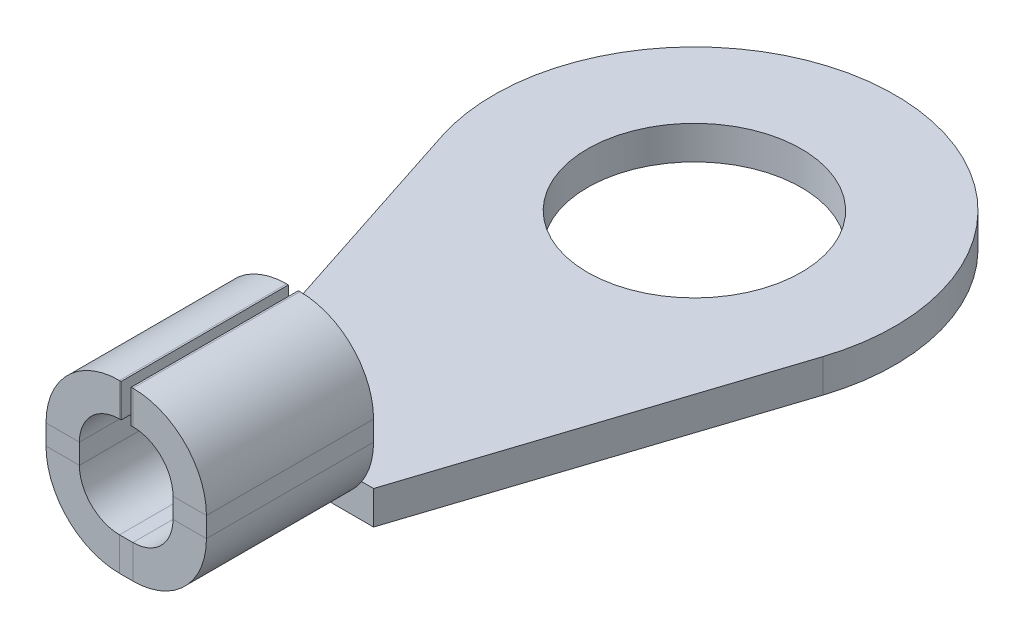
ISO-10303-21;
HEADER;
FILE_DESCRIPTION(('STEP AP214'),'2;1');
FILE_NAME('part.step','',(''),(''),'','','');
FILE_SCHEMA(('AUTOMOTIVE_DESIGN { 1 0 10303 214 1 1 1 1 }'));
ENDSEC;
DATA;
#1=APPLICATION_CONTEXT('core data for automotive mechanical design processes');
#2=APPLICATION_PROTOCOL_DEFINITION('international standard','automotive_design',2000,#1);
#3=PRODUCT_CONTEXT('',#1,'mechanical');
#4=PRODUCT('Part','Part','',(#3));
#5=PRODUCT_RELATED_PRODUCT_CATEGORY('part','',(#4));
#6=PRODUCT_DEFINITION_FORMATION('','',#4);
#7=PRODUCT_DEFINITION_CONTEXT('part definition',#1,'design');
#8=PRODUCT_DEFINITION('design','',#6,#7);
#9=PRODUCT_DEFINITION_SHAPE('','',#8);
#10=(LENGTH_UNIT() NAMED_UNIT(*) SI_UNIT(.MILLI.,.METRE.));
#11=(NAMED_UNIT(*) PLANE_ANGLE_UNIT() SI_UNIT($,.RADIAN.));
#12=(NAMED_UNIT(*) SI_UNIT($,.STERADIAN.) SOLID_ANGLE_UNIT());
#13=UNCERTAINTY_MEASURE_WITH_UNIT(LENGTH_MEASURE(1.E-05),#10,'distance_accuracy_value','');
#14=(GEOMETRIC_REPRESENTATION_CONTEXT(3) GLOBAL_UNCERTAINTY_ASSIGNED_CONTEXT((#13)) GLOBAL_UNIT_ASSIGNED_CONTEXT((#10,
#11,#12)) REPRESENTATION_CONTEXT('',''));
#15=CARTESIAN_POINT('',(0.,0.,0.));
#16=DIRECTION('',(0.,0.,1.));
#17=DIRECTION('',(1.,0.,0.));
#18=AXIS2_PLACEMENT_3D('',#15,#16,#17);
#19=CARTESIAN_POINT('',(2.4,0.,-5.));
#20=DIRECTION('',(1.,0.,0.));
#21=DIRECTION('',(0.,0.,-1.));
#22=AXIS2_PLACEMENT_3D('',#19,#20,#21);
#23=PLANE('',#22);
#24=DIRECTION('',(0.,1.,0.));
#25=VECTOR('',#24,1.);
#26=CARTESIAN_POINT('',(2.4,0.,-5.));
#27=LINE('',#26,#25);
#28=CARTESIAN_POINT('',(2.4,1.2,-5.));
#29=VERTEX_POINT('',#28);
#30=CARTESIAN_POINT('',(2.4,1.8,-5.));
#31=VERTEX_POINT('',#30);
#32=EDGE_CURVE('E406',#29,#31,#27,.T.);
#33=ORIENTED_EDGE('',*,*,#32,.T.);
#34=DIRECTION('',(0.,0.,-1.));
#35=VECTOR('',#34,1.);
#36=CARTESIAN_POINT('',(2.4,1.8,-5.));
#37=LINE('',#36,#35);
#38=CARTESIAN_POINT('',(2.4,1.8,0.));
#39=VERTEX_POINT('',#38);
#40=EDGE_CURVE('E287',#31,#39,#37,.F.);
#41=ORIENTED_EDGE('',*,*,#40,.T.);
#42=DIRECTION('',(0.,1.,0.));
#43=VECTOR('',#42,1.);
#44=CARTESIAN_POINT('',(2.4,0.,0.));
#45=LINE('',#44,#43);
#46=CARTESIAN_POINT('',(2.4,1.2,0.));
#47=VERTEX_POINT('',#46);
#48=EDGE_CURVE('E405',#47,#39,#45,.T.);
#49=ORIENTED_EDGE('',*,*,#48,.F.);
#50=DIRECTION('',(0.,0.,1.));
#51=VECTOR('',#50,1.);
#52=CARTESIAN_POINT('',(2.4,1.2,-5.));
#53=LINE('',#52,#51);
#54=EDGE_CURVE('E454',#29,#47,#53,.T.);
#55=ORIENTED_EDGE('',*,*,#54,.F.);
#56=EDGE_LOOP('',(#33,#41,#49,#55));
#57=FACE_BOUND('',#56,.T.);
#58=ADVANCED_FACE('F77',(#57),#23,.T.);
#59=CARTESIAN_POINT('',(1.4,0.,-5.));
#60=DIRECTION('',(1.,0.,0.));
#61=DIRECTION('',(0.,0.,-1.));
#62=AXIS2_PLACEMENT_3D('',#59,#60,#61);
#63=PLANE('',#62);
#64=DIRECTION('',(0.,0.,-1.));
#65=VECTOR('',#64,1.);
#66=CARTESIAN_POINT('',(1.4,1.8,-5.));
#67=LINE('',#66,#65);
#68=CARTESIAN_POINT('',(1.4,1.8,-5.));
#69=VERTEX_POINT('',#68);
#70=CARTESIAN_POINT('',(1.4,1.8,0.));
#71=VERTEX_POINT('',#70);
#72=EDGE_CURVE('E300',#69,#71,#67,.F.);
#73=ORIENTED_EDGE('',*,*,#72,.F.);
#74=DIRECTION('',(0.,1.,0.));
#75=VECTOR('',#74,1.);
#76=CARTESIAN_POINT('',(1.4,0.,-5.));
#77=LINE('',#76,#75);
#78=CARTESIAN_POINT('',(1.4,1.2,-5.));
#79=VERTEX_POINT('',#78);
#80=EDGE_CURVE('E409',#79,#69,#77,.T.);
#81=ORIENTED_EDGE('',*,*,#80,.F.);
#82=DIRECTION('',(0.,0.,1.));
#83=VECTOR('',#82,1.);
#84=CARTESIAN_POINT('',(1.4,1.2,-5.));
#85=LINE('',#84,#83);
#86=CARTESIAN_POINT('',(1.4,1.2,0.));
#87=VERTEX_POINT('',#86);
#88=EDGE_CURVE('E427',#79,#87,#85,.T.);
#89=ORIENTED_EDGE('',*,*,#88,.T.);
#90=DIRECTION('',(0.,1.,0.));
#91=VECTOR('',#90,1.);
#92=CARTESIAN_POINT('',(1.4,0.,0.));
#93=LINE('',#92,#91);
#94=EDGE_CURVE('E430',#87,#71,#93,.T.);
#95=ORIENTED_EDGE('',*,*,#94,.T.);
#96=EDGE_LOOP('',(#73,#81,#89,#95));
#97=FACE_BOUND('',#96,.T.);
#98=ADVANCED_FACE('F558',(#97),#63,.F.);
#99=CARTESIAN_POINT('',(0.2,1.2,-5.));
#100=DIRECTION('',(0.,0.,-1.));
#101=DIRECTION('',(-1.,0.,0.));
#102=AXIS2_PLACEMENT_3D('',#99,#100,#101);
#103=PLANE('',#102);
#104=ORIENTED_EDGE('',*,*,#80,.T.);
#105=DIRECTION('',(1.,0.,0.));
#106=VECTOR('',#105,1.);
#107=CARTESIAN_POINT('',(1.4,1.8,-5.));
#108=LINE('',#107,#106);
#109=EDGE_CURVE('E294',#69,#31,#108,.T.);
#110=ORIENTED_EDGE('',*,*,#109,.T.);
#111=ORIENTED_EDGE('',*,*,#32,.F.);
#112=DIRECTION('',(-1.,0.,0.));
#113=VECTOR('',#112,1.);
#114=CARTESIAN_POINT('',(2.4,1.2,-5.));
#115=LINE('',#114,#113);
#116=EDGE_CURVE('E481',#29,#79,#115,.T.);
#117=ORIENTED_EDGE('',*,*,#116,.T.);
#118=EDGE_LOOP('',(#104,#110,#111,#117));
#119=FACE_BOUND('',#118,.T.);
#120=ADVANCED_FACE('F564',(#119),#103,.T.);
#121=CARTESIAN_POINT('',(-2.4,4.,-5.));
#122=DIRECTION('',(-1.,0.,0.));
#123=DIRECTION('',(0.,0.,1.));
#124=AXIS2_PLACEMENT_3D('',#121,#122,#123);
#125=PLANE('',#124);
#126=DIRECTION('',(0.,1.,0.));
#127=VECTOR('',#126,1.);
#128=CARTESIAN_POINT('',(-2.4,4.,0.));
#129=LINE('',#128,#127);
#130=CARTESIAN_POINT('',(-2.4,1.8,0.));
#131=VERTEX_POINT('',#130);
#132=CARTESIAN_POINT('',(-2.4,1.2,0.));
#133=VERTEX_POINT('',#132);
#134=EDGE_CURVE('E444',#131,#133,#129,.F.);
#135=ORIENTED_EDGE('',*,*,#134,.F.);
#136=DIRECTION('',(0.,0.,1.));
#137=VECTOR('',#136,1.);
#138=CARTESIAN_POINT('',(-2.4,1.8,0.));
#139=LINE('',#138,#137);
#140=CARTESIAN_POINT('',(-2.4,1.80000000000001,-5.));
#141=VERTEX_POINT('',#140);
#142=EDGE_CURVE('E341',#131,#141,#139,.F.);
#143=ORIENTED_EDGE('',*,*,#142,.T.);
#144=DIRECTION('',(0.,1.,0.));
#145=VECTOR('',#144,1.);
#146=CARTESIAN_POINT('',(-2.4,4.,-5.));
#147=LINE('',#146,#145);
#148=CARTESIAN_POINT('',(-2.4,1.2,-5.));
#149=VERTEX_POINT('',#148);
#150=EDGE_CURVE('E420',#141,#149,#147,.F.);
#151=ORIENTED_EDGE('',*,*,#150,.T.);
#152=DIRECTION('',(0.,0.,1.));
#153=VECTOR('',#152,1.);
#154=CARTESIAN_POINT('',(-2.4,1.2,-5.));
#155=LINE('',#154,#153);
#156=EDGE_CURVE('E464',#149,#133,#155,.T.);
#157=ORIENTED_EDGE('',*,*,#156,.T.);
#158=EDGE_LOOP('',(#135,#143,#151,#157));
#159=FACE_BOUND('',#158,.T.);
#160=ADVANCED_FACE('F508',(#159),#125,.T.);
#161=CARTESIAN_POINT('',(-1.4,4.,-5.));
#162=DIRECTION('',(-1.,0.,0.));
#163=DIRECTION('',(0.,0.,1.));
#164=AXIS2_PLACEMENT_3D('',#161,#162,#163);
#165=PLANE('',#164);
#166=DIRECTION('',(0.,0.,1.));
#167=VECTOR('',#166,1.);
#168=CARTESIAN_POINT('',(-1.4,1.8,0.));
#169=LINE('',#168,#167);
#170=CARTESIAN_POINT('',(-1.4,1.8,0.));
#171=VERTEX_POINT('',#170);
#172=CARTESIAN_POINT('',(-1.4,1.8,-5.));
#173=VERTEX_POINT('',#172);
#174=EDGE_CURVE('E352',#171,#173,#169,.F.);
#175=ORIENTED_EDGE('',*,*,#174,.F.);
#176=DIRECTION('',(0.,-1.,0.));
#177=VECTOR('',#176,1.);
#178=CARTESIAN_POINT('',(-1.4,4.,0.));
#179=LINE('',#178,#177);
#180=CARTESIAN_POINT('',(-1.4,1.2,0.));
#181=VERTEX_POINT('',#180);
#182=EDGE_CURVE('E442',#171,#181,#179,.T.);
#183=ORIENTED_EDGE('',*,*,#182,.T.);
#184=DIRECTION('',(0.,0.,1.));
#185=VECTOR('',#184,1.);
#186=CARTESIAN_POINT('',(-1.4,1.2,-5.));
#187=LINE('',#186,#185);
#188=CARTESIAN_POINT('',(-1.4,1.2,-5.));
#189=VERTEX_POINT('',#188);
#190=EDGE_CURVE('E467',#189,#181,#187,.T.);
#191=ORIENTED_EDGE('',*,*,#190,.F.);
#192=DIRECTION('',(0.,-1.,0.));
#193=VECTOR('',#192,1.);
#194=CARTESIAN_POINT('',(-1.4,4.,-5.));
#195=LINE('',#194,#193);
#196=EDGE_CURVE('E418',#173,#189,#195,.T.);
#197=ORIENTED_EDGE('',*,*,#196,.F.);
#198=EDGE_LOOP('',(#175,#183,#191,#197));
#199=FACE_BOUND('',#198,.T.);
#200=ADVANCED_FACE('F597',(#199),#165,.F.);
#201=CARTESIAN_POINT('',(0.2,1.2,0.));
#202=DIRECTION('',(0.,0.,-1.));
#203=DIRECTION('',(-1.,0.,0.));
#204=AXIS2_PLACEMENT_3D('',#201,#202,#203);
#205=PLANE('',#204);
#206=DIRECTION('',(-1.,0.,0.));
#207=VECTOR('',#206,1.);
#208=CARTESIAN_POINT('',(-1.4,1.8,0.));
#209=LINE('',#208,#207);
#210=EDGE_CURVE('E346',#171,#131,#209,.T.);
#211=ORIENTED_EDGE('',*,*,#210,.T.);
#212=ORIENTED_EDGE('',*,*,#134,.T.);
#213=DIRECTION('',(1.,0.,0.));
#214=VECTOR('',#213,1.);
#215=CARTESIAN_POINT('',(-2.4,1.2,0.));
#216=LINE('',#215,#214);
#217=EDGE_CURVE('E483',#133,#181,#216,.T.);
#218=ORIENTED_EDGE('',*,*,#217,.T.);
#219=ORIENTED_EDGE('',*,*,#182,.F.);
#220=EDGE_LOOP('',(#211,#212,#218,#219));
#221=FACE_BOUND('',#220,.T.);
#222=ADVANCED_FACE('F590',(#221),#205,.F.);
#223=CARTESIAN_POINT('',(-1.4,1.2,-5.));
#224=DIRECTION('',(0.,0.,-1.));
#225=DIRECTION('',(-1.,0.,0.));
#226=AXIS2_PLACEMENT_3D('',#223,#224,#225);
#227=PLANE('',#226);
#228=DIRECTION('',(1.,0.,0.));
#229=VECTOR('',#228,1.);
#230=CARTESIAN_POINT('',(-2.4,0.,-5.));
#231=LINE('',#230,#229);
#232=CARTESIAN_POINT('',(-2.04390889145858,0.,-5.));
#233=VERTEX_POINT('',#232);
#234=CARTESIAN_POINT('',(-0.2,0.,-5.));
#235=VERTEX_POINT('',#234);
#236=EDGE_CURVE('E389',#233,#235,#231,.T.);
#237=ORIENTED_EDGE('',*,*,#236,.F.);
#238=CARTESIAN_POINT('',(-0.2,1.2,-5.));
#239=DIRECTION('',(0.,0.,1.));
#240=DIRECTION('',(1.,0.,0.));
#241=AXIS2_PLACEMENT_3D('',#238,#239,#240);
#242=CIRCLE('',#241,2.2);
#243=EDGE_CURVE('E422',#149,#233,#242,.T.);
#244=ORIENTED_EDGE('',*,*,#243,.F.);
#245=DIRECTION('',(-1.,0.,0.));
#246=VECTOR('',#245,1.);
#247=CARTESIAN_POINT('',(-1.4,1.2,-5.));
#248=LINE('',#247,#246);
#249=EDGE_CURVE('E13',#189,#149,#248,.T.);
#250=ORIENTED_EDGE('',*,*,#249,.F.);
#251=CARTESIAN_POINT('',(-0.2,1.2,-5.));
#252=DIRECTION('',(0.,0.,-1.));
#253=DIRECTION('',(-1.,0.,0.));
#254=AXIS2_PLACEMENT_3D('',#251,#252,#253);
#255=CIRCLE('',#254,1.2);
#256=EDGE_CURVE('E416',#189,#235,#255,.F.);
#257=ORIENTED_EDGE('',*,*,#256,.T.);
#258=EDGE_LOOP('',(#237,#244,#250,#257));
#259=FACE_BOUND('',#258,.T.);
#260=ADVANCED_FACE('F79',(#259),#227,.T.);
#261=CARTESIAN_POINT('',(-0.2,-1.,-5.));
#262=DIRECTION('',(0.,0.,-1.));
#263=DIRECTION('',(-1.,0.,0.));
#264=AXIS2_PLACEMENT_3D('',#261,#262,#263);
#265=PLANE('',#264);
#266=DIRECTION('',(-1.,0.,0.));
#267=VECTOR('',#266,1.);
#268=CARTESIAN_POINT('',(-1.4,1.8,-5.));
#269=LINE('',#268,#267);
#270=EDGE_CURVE('E356',#173,#141,#269,.T.);
#271=ORIENTED_EDGE('',*,*,#270,.F.);
#272=ORIENTED_EDGE('',*,*,#196,.T.);
#273=ORIENTED_EDGE('',*,*,#249,.T.);
#274=ORIENTED_EDGE('',*,*,#150,.F.);
#275=EDGE_LOOP('',(#271,#272,#273,#274));
#276=FACE_BOUND('',#275,.T.);
#277=ADVANCED_FACE('F584',(#276),#265,.T.);
#278=CARTESIAN_POINT('',(-0.2,0.,0.));
#279=DIRECTION('',(0.,0.,1.));
#280=DIRECTION('',(1.,0.,0.));
#281=AXIS2_PLACEMENT_3D('',#278,#279,#280);
#282=PLANE('',#281);
#283=DIRECTION('',(0.,-1.,0.));
#284=VECTOR('',#283,1.);
#285=CARTESIAN_POINT('',(-0.2,0.,0.));
#286=LINE('',#285,#284);
#287=CARTESIAN_POINT('',(-0.2,0.,0.));
#288=VERTEX_POINT('',#287);
#289=CARTESIAN_POINT('',(-0.2,-1.,0.));
#290=VERTEX_POINT('',#289);
#291=EDGE_CURVE('E85',#288,#290,#286,.T.);
#292=ORIENTED_EDGE('',*,*,#291,.F.);
#293=CARTESIAN_POINT('',(-0.2,1.2,0.));
#294=DIRECTION('',(0.,0.,-1.));
#295=DIRECTION('',(-1.,0.,0.));
#296=AXIS2_PLACEMENT_3D('',#293,#294,#295);
#297=CIRCLE('',#296,1.2);
#298=EDGE_CURVE('E439',#181,#288,#297,.F.);
#299=ORIENTED_EDGE('',*,*,#298,.F.);
#300=ORIENTED_EDGE('',*,*,#217,.F.);
#301=CARTESIAN_POINT('',(-0.2,1.2,0.));
#302=DIRECTION('',(0.,0.,1.));
#303=DIRECTION('',(1.,0.,0.));
#304=AXIS2_PLACEMENT_3D('',#301,#302,#303);
#305=CIRCLE('',#304,2.2);
#306=EDGE_CURVE('E446',#133,#290,#305,.T.);
#307=ORIENTED_EDGE('',*,*,#306,.T.);
#308=EDGE_LOOP('',(#292,#299,#300,#307));
#309=FACE_BOUND('',#308,.T.);
#310=ADVANCED_FACE('F503',(#309),#282,.T.);
#311=CARTESIAN_POINT('',(-2.4,1.2,0.));
#312=DIRECTION('',(0.,0.,1.));
#313=DIRECTION('',(1.,0.,0.));
#314=AXIS2_PLACEMENT_3D('',#311,#312,#313);
#315=PLANE('',#314);
#316=DIRECTION('',(1.,0.,0.));
#317=VECTOR('',#316,1.);
#318=CARTESIAN_POINT('',(-1.4,0.,0.));
#319=LINE('',#318,#317);
#320=CARTESIAN_POINT('',(0.2,0.,0.));
#321=VERTEX_POINT('',#320);
#322=EDGE_CURVE('E436',#288,#321,#319,.T.);
#323=ORIENTED_EDGE('',*,*,#322,.F.);
#324=ORIENTED_EDGE('',*,*,#291,.T.);
#325=DIRECTION('',(1.,0.,0.));
#326=VECTOR('',#325,1.);
#327=CARTESIAN_POINT('',(-1.4,-1.,0.));
#328=LINE('',#327,#326);
#329=CARTESIAN_POINT('',(0.199999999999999,-1.,0.));
#330=VERTEX_POINT('',#329);
#331=EDGE_CURVE('E449',#290,#330,#328,.T.);
#332=ORIENTED_EDGE('',*,*,#331,.T.);
#333=DIRECTION('',(0.,1.,0.));
#334=VECTOR('',#333,1.);
#335=CARTESIAN_POINT('',(0.199999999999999,-1.,0.));
#336=LINE('',#335,#334);
#337=EDGE_CURVE('E457',#330,#321,#336,.T.);
#338=ORIENTED_EDGE('',*,*,#337,.T.);
#339=EDGE_LOOP('',(#323,#324,#332,#338));
#340=FACE_BOUND('',#339,.T.);
#341=ADVANCED_FACE('F487',(#340),#315,.T.);
#342=CARTESIAN_POINT('',(0.2,0.,-5.));
#343=DIRECTION('',(0.,0.,-1.));
#344=DIRECTION('',(-1.,0.,0.));
#345=AXIS2_PLACEMENT_3D('',#342,#343,#344);
#346=PLANE('',#345);
#347=CARTESIAN_POINT('',(0.2,0.,-5.));
#348=VERTEX_POINT('',#347);
#349=CARTESIAN_POINT('',(2.04390889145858,0.,-5.));
#350=VERTEX_POINT('',#349);
#351=EDGE_CURVE('E518',#348,#350,#231,.T.);
#352=ORIENTED_EDGE('',*,*,#351,.F.);
#353=CARTESIAN_POINT('',(0.2,1.2,-5.));
#354=DIRECTION('',(0.,0.,-1.));
#355=DIRECTION('',(-1.,0.,0.));
#356=AXIS2_PLACEMENT_3D('',#353,#354,#355);
#357=CIRCLE('',#356,1.2);
#358=EDGE_CURVE('E413',#348,#79,#357,.F.);
#359=ORIENTED_EDGE('',*,*,#358,.T.);
#360=ORIENTED_EDGE('',*,*,#116,.F.);
#361=CARTESIAN_POINT('',(0.2,1.2,-5.));
#362=DIRECTION('',(0.,0.,1.));
#363=DIRECTION('',(1.,0.,0.));
#364=AXIS2_PLACEMENT_3D('',#361,#362,#363);
#365=CIRCLE('',#364,2.2);
#366=EDGE_CURVE('E100',#350,#29,#365,.T.);
#367=ORIENTED_EDGE('',*,*,#366,.F.);
#368=EDGE_LOOP('',(#352,#359,#360,#367));
#369=FACE_BOUND('',#368,.T.);
#370=ADVANCED_FACE('F577',(#369),#346,.T.);
#371=CARTESIAN_POINT('',(1.4,1.2,0.));
#372=DIRECTION('',(0.,0.,1.));
#373=DIRECTION('',(1.,0.,0.));
#374=AXIS2_PLACEMENT_3D('',#371,#372,#373);
#375=PLANE('',#374);
#376=DIRECTION('',(1.,0.,0.));
#377=VECTOR('',#376,1.);
#378=CARTESIAN_POINT('',(1.4,1.2,0.));
#379=LINE('',#378,#377);
#380=EDGE_CURVE('E479',#87,#47,#379,.T.);
#381=ORIENTED_EDGE('',*,*,#380,.F.);
#382=CARTESIAN_POINT('',(0.2,1.2,0.));
#383=DIRECTION('',(0.,0.,-1.));
#384=DIRECTION('',(-1.,0.,0.));
#385=AXIS2_PLACEMENT_3D('',#382,#383,#384);
#386=CIRCLE('',#385,1.2);
#387=EDGE_CURVE('E433',#321,#87,#386,.F.);
#388=ORIENTED_EDGE('',*,*,#387,.F.);
#389=ORIENTED_EDGE('',*,*,#337,.F.);
#390=CARTESIAN_POINT('',(0.2,1.2,0.));
#391=DIRECTION('',(0.,0.,1.));
#392=DIRECTION('',(1.,0.,0.));
#393=AXIS2_PLACEMENT_3D('',#390,#391,#392);
#394=CIRCLE('',#393,2.2);
#395=EDGE_CURVE('E410',#330,#47,#394,.T.);
#396=ORIENTED_EDGE('',*,*,#395,.T.);
#397=EDGE_LOOP('',(#381,#388,#389,#396));
#398=FACE_BOUND('',#397,.T.);
#399=ADVANCED_FACE('F573',(#398),#375,.T.);
#400=CARTESIAN_POINT('',(0.199999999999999,-1.,0.));
#401=DIRECTION('',(0.,0.,1.));
#402=DIRECTION('',(1.,0.,0.));
#403=AXIS2_PLACEMENT_3D('',#400,#401,#402);
#404=PLANE('',#403);
#405=DIRECTION('',(1.,0.,0.));
#406=VECTOR('',#405,1.);
#407=CARTESIAN_POINT('',(1.4,1.8,0.));
#408=LINE('',#407,#406);
#409=EDGE_CURVE('E305',#71,#39,#408,.T.);
#410=ORIENTED_EDGE('',*,*,#409,.F.);
#411=ORIENTED_EDGE('',*,*,#94,.F.);
#412=ORIENTED_EDGE('',*,*,#380,.T.);
#413=ORIENTED_EDGE('',*,*,#48,.T.);
#414=EDGE_LOOP('',(#410,#411,#412,#413));
#415=FACE_BOUND('',#414,.T.);
#416=ADVANCED_FACE('F569',(#415),#404,.T.);
#417=CARTESIAN_POINT('',(0.2,1.2,-5.));
#418=DIRECTION('',(0.,0.,1.));
#419=DIRECTION('',(1.,0.,0.));
#420=AXIS2_PLACEMENT_3D('',#417,#418,#419);
#421=CYLINDRICAL_SURFACE('',#420,2.2);
#422=ORIENTED_EDGE('',*,*,#395,.F.);
#423=DIRECTION('',(0.,0.,1.));
#424=VECTOR('',#423,1.);
#425=CARTESIAN_POINT('',(0.199999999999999,-1.,-5.));
#426=LINE('',#425,#424);
#427=CARTESIAN_POINT('',(0.199999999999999,-1.,-5.));
#428=VERTEX_POINT('',#427);
#429=EDGE_CURVE('E458',#428,#330,#426,.T.);
#430=ORIENTED_EDGE('',*,*,#429,.F.);
#431=EDGE_CURVE('E425',#428,#350,#365,.T.);
#432=ORIENTED_EDGE('',*,*,#431,.T.);
#433=ORIENTED_EDGE('',*,*,#366,.T.);
#434=ORIENTED_EDGE('',*,*,#54,.T.);
#435=EDGE_LOOP('',(#422,#430,#432,#433,#434));
#436=FACE_BOUND('',#435,.T.);
#437=ADVANCED_FACE('F572',(#436),#421,.T.);
#438=CARTESIAN_POINT('',(-1.4,-1.,-5.));
#439=DIRECTION('',(0.,-1.,0.));
#440=DIRECTION('',(0.,0.,-1.));
#441=AXIS2_PLACEMENT_3D('',#438,#439,#440);
#442=PLANE('',#441);
#443=ORIENTED_EDGE('',*,*,#331,.F.);
#444=DIRECTION('',(0.,0.,1.));
#445=VECTOR('',#444,1.);
#446=CARTESIAN_POINT('',(-0.2,-1.,-5.));
#447=LINE('',#446,#445);
#448=CARTESIAN_POINT('',(-0.2,-1.,-5.));
#449=VERTEX_POINT('',#448);
#450=EDGE_CURVE('E461',#449,#290,#447,.T.);
#451=ORIENTED_EDGE('',*,*,#450,.F.);
#452=DIRECTION('',(1.,0.,0.));
#453=VECTOR('',#452,1.);
#454=CARTESIAN_POINT('',(-2.4,-1.,-5.));
#455=LINE('',#454,#453);
#456=CARTESIAN_POINT('',(-2.4,-1.,-5.));
#457=VERTEX_POINT('',#456);
#458=EDGE_CURVE('E372',#457,#449,#455,.T.);
#459=ORIENTED_EDGE('',*,*,#458,.F.);
#460=DIRECTION('',(0.309842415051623,0.,0.950787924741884));
#461=VECTOR('',#460,1.);
#462=CARTESIAN_POINT('',(-5.7047275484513,-1.,-15.1409455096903));
#463=LINE('',#462,#461);
#464=CARTESIAN_POINT('',(-5.7047275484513,-1.,-15.1409455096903));
#465=VERTEX_POINT('',#464);
#466=EDGE_CURVE('E367',#465,#457,#463,.T.);
#467=ORIENTED_EDGE('',*,*,#466,.F.);
#468=CARTESIAN_POINT('',(0.,-1.,-17.));
#469=DIRECTION('',(0.,1.,0.));
#470=DIRECTION('',(0.,0.,1.));
#471=AXIS2_PLACEMENT_3D('',#468,#469,#470);
#472=CIRCLE('',#471,6.);
#473=CARTESIAN_POINT('',(5.7047275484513,-1.,-15.1409455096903));
#474=VERTEX_POINT('',#473);
#475=EDGE_CURVE('E378',#474,#465,#472,.T.);
#476=ORIENTED_EDGE('',*,*,#475,.F.);
#477=DIRECTION('',(0.309842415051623,0.,-0.950787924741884));
#478=VECTOR('',#477,1.);
#479=CARTESIAN_POINT('',(2.4,-1.,-5.));
#480=LINE('',#479,#478);
#481=CARTESIAN_POINT('',(2.4,-1.,-5.));
#482=VERTEX_POINT('',#481);
#483=EDGE_CURVE('E375',#482,#474,#480,.T.);
#484=ORIENTED_EDGE('',*,*,#483,.F.);
#485=EDGE_CURVE('E370',#428,#482,#455,.T.);
#486=ORIENTED_EDGE('',*,*,#485,.F.);
#487=ORIENTED_EDGE('',*,*,#429,.T.);
#488=EDGE_LOOP('',(#443,#451,#459,#467,#476,#484,#486,#487));
#489=FACE_BOUND('',#488,.T.);
#490=CARTESIAN_POINT('',(0.,-1.,-17.));
#491=DIRECTION('',(0.,1.,0.));
#492=DIRECTION('',(0.,0.,1.));
#493=AXIS2_PLACEMENT_3D('',#490,#491,#492);
#494=CIRCLE('',#493,3.2);
#495=CARTESIAN_POINT('',(0.,-1.,-13.8));
#496=VERTEX_POINT('',#495);
#497=EDGE_CURVE('E361',#496,#496,#494,.T.);
#498=ORIENTED_EDGE('',*,*,#497,.T.);
#499=EDGE_LOOP('',(#498));
#500=FACE_BOUND('',#499,.T.);
#501=ADVANCED_FACE('F499',(#489,#500),#442,.T.);
#502=CARTESIAN_POINT('',(-0.2,1.2,-5.));
#503=DIRECTION('',(0.,0.,1.));
#504=DIRECTION('',(1.,0.,0.));
#505=AXIS2_PLACEMENT_3D('',#502,#503,#504);
#506=CYLINDRICAL_SURFACE('',#505,2.2);
#507=ORIENTED_EDGE('',*,*,#306,.F.);
#508=ORIENTED_EDGE('',*,*,#156,.F.);
#509=ORIENTED_EDGE('',*,*,#243,.T.);
#510=CARTESIAN_POINT('',(-0.2,1.2,-5.));
#511=DIRECTION('',(0.,0.,1.));
#512=DIRECTION('',(1.,0.,0.));
#513=AXIS2_PLACEMENT_3D('',#510,#511,#512);
#514=CIRCLE('',#513,2.2);
#515=EDGE_CURVE('E396',#449,#233,#514,.F.);
#516=ORIENTED_EDGE('',*,*,#515,.F.);
#517=ORIENTED_EDGE('',*,*,#450,.T.);
#518=EDGE_LOOP('',(#507,#508,#509,#516,#517));
#519=FACE_BOUND('',#518,.T.);
#520=ADVANCED_FACE('F495',(#519),#506,.T.);
#521=CARTESIAN_POINT('',(-0.2,1.2,-5.));
#522=DIRECTION('',(0.,0.,1.));
#523=DIRECTION('',(1.,0.,0.));
#524=AXIS2_PLACEMENT_3D('',#521,#522,#523);
#525=CYLINDRICAL_SURFACE('',#524,1.2);
#526=ORIENTED_EDGE('',*,*,#298,.T.);
#527=DIRECTION('',(0.,0.,1.));
#528=VECTOR('',#527,1.);
#529=CARTESIAN_POINT('',(-0.2,0.,-5.));
#530=LINE('',#529,#528);
#531=EDGE_CURVE('E470',#235,#288,#530,.T.);
#532=ORIENTED_EDGE('',*,*,#531,.F.);
#533=ORIENTED_EDGE('',*,*,#256,.F.);
#534=ORIENTED_EDGE('',*,*,#190,.T.);
#535=EDGE_LOOP('',(#526,#532,#533,#534));
#536=FACE_BOUND('',#535,.T.);
#537=ADVANCED_FACE('F599',(#536),#525,.F.);
#538=CARTESIAN_POINT('',(-1.4,0.,-5.));
#539=DIRECTION('',(0.,-1.,0.));
#540=DIRECTION('',(0.,0.,-1.));
#541=AXIS2_PLACEMENT_3D('',#538,#539,#540);
#542=PLANE('',#541);
#543=ORIENTED_EDGE('',*,*,#322,.T.);
#544=DIRECTION('',(0.,0.,1.));
#545=VECTOR('',#544,1.);
#546=CARTESIAN_POINT('',(0.2,0.,-5.));
#547=LINE('',#546,#545);
#548=EDGE_CURVE('E473',#348,#321,#547,.T.);
#549=ORIENTED_EDGE('',*,*,#548,.F.);
#550=ORIENTED_EDGE('',*,*,#351,.T.);
#551=CARTESIAN_POINT('',(2.4,0.,-5.));
#552=VERTEX_POINT('',#551);
#553=EDGE_CURVE('E384',#350,#552,#231,.T.);
#554=ORIENTED_EDGE('',*,*,#553,.T.);
#555=DIRECTION('',(0.309842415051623,0.,-0.950787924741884));
#556=VECTOR('',#555,1.);
#557=CARTESIAN_POINT('',(2.4,0.,-5.));
#558=LINE('',#557,#556);
#559=CARTESIAN_POINT('',(5.7047275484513,0.,-15.1409455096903));
#560=VERTEX_POINT('',#559);
#561=EDGE_CURVE('E388',#552,#560,#558,.T.);
#562=ORIENTED_EDGE('',*,*,#561,.T.);
#563=CARTESIAN_POINT('',(0.,0.,-17.));
#564=DIRECTION('',(0.,1.,0.));
#565=DIRECTION('',(0.,0.,1.));
#566=AXIS2_PLACEMENT_3D('',#563,#564,#565);
#567=CIRCLE('',#566,6.);
#568=CARTESIAN_POINT('',(-5.7047275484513,0.,-15.1409455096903));
#569=VERTEX_POINT('',#568);
#570=EDGE_CURVE('E371',#560,#569,#567,.T.);
#571=ORIENTED_EDGE('',*,*,#570,.T.);
#572=DIRECTION('',(0.309842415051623,0.,0.950787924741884));
#573=VECTOR('',#572,1.);
#574=CARTESIAN_POINT('',(-5.7047275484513,0.,-15.1409455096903));
#575=LINE('',#574,#573);
#576=CARTESIAN_POINT('',(-2.4,0.,-5.));
#577=VERTEX_POINT('',#576);
#578=EDGE_CURVE('E364',#569,#577,#575,.T.);
#579=ORIENTED_EDGE('',*,*,#578,.T.);
#580=EDGE_CURVE('E385',#577,#233,#231,.T.);
#581=ORIENTED_EDGE('',*,*,#580,.T.);
#582=ORIENTED_EDGE('',*,*,#236,.T.);
#583=ORIENTED_EDGE('',*,*,#531,.T.);
#584=EDGE_LOOP('',(#543,#549,#550,#554,#562,#571,#579,#581,#582,#583));
#585=FACE_BOUND('',#584,.T.);
#586=CARTESIAN_POINT('',(0.,0.,-17.));
#587=DIRECTION('',(0.,1.,0.));
#588=DIRECTION('',(0.,0.,1.));
#589=AXIS2_PLACEMENT_3D('',#586,#587,#588);
#590=CIRCLE('',#589,3.2);
#591=CARTESIAN_POINT('',(0.,0.,-13.8));
#592=VERTEX_POINT('',#591);
#593=EDGE_CURVE('E358',#592,#592,#590,.T.);
#594=ORIENTED_EDGE('',*,*,#593,.F.);
#595=EDGE_LOOP('',(#594));
#596=FACE_BOUND('',#595,.T.);
#597=ADVANCED_FACE('F522',(#585,#596),#542,.F.);
#598=CARTESIAN_POINT('',(0.2,1.2,-5.));
#599=DIRECTION('',(0.,0.,1.));
#600=DIRECTION('',(1.,0.,0.));
#601=AXIS2_PLACEMENT_3D('',#598,#599,#600);
#602=CYLINDRICAL_SURFACE('',#601,1.2);
#603=ORIENTED_EDGE('',*,*,#387,.T.);
#604=ORIENTED_EDGE('',*,*,#88,.F.);
#605=ORIENTED_EDGE('',*,*,#358,.F.);
#606=ORIENTED_EDGE('',*,*,#548,.T.);
#607=EDGE_LOOP('',(#603,#604,#605,#606));
#608=FACE_BOUND('',#607,.T.);
#609=ADVANCED_FACE('F556',(#608),#602,.F.);
#610=CARTESIAN_POINT('',(-2.4,-1.,-5.));
#611=DIRECTION('',(0.,0.,1.));
#612=DIRECTION('',(1.,0.,0.));
#613=AXIS2_PLACEMENT_3D('',#610,#611,#612);
#614=PLANE('',#613);
#615=ORIENTED_EDGE('',*,*,#553,.F.);
#616=ORIENTED_EDGE('',*,*,#431,.F.);
#617=ORIENTED_EDGE('',*,*,#485,.T.);
#618=DIRECTION('',(0.,1.,0.));
#619=VECTOR('',#618,1.);
#620=CARTESIAN_POINT('',(2.4,-1.,-5.));
#621=LINE('',#620,#619);
#622=EDGE_CURVE('E399',#482,#552,#621,.T.);
#623=ORIENTED_EDGE('',*,*,#622,.T.);
#624=EDGE_LOOP('',(#615,#616,#617,#623));
#625=FACE_BOUND('',#624,.T.);
#626=ADVANCED_FACE('F529',(#625),#614,.T.);
#627=CARTESIAN_POINT('',(-5.7047275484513,-1.,-15.1409455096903));
#628=DIRECTION('',(-0.950787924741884,0.,0.309842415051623));
#629=DIRECTION('',(0.309842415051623,0.,0.950787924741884));
#630=AXIS2_PLACEMENT_3D('',#627,#628,#629);
#631=PLANE('',#630);
#632=ORIENTED_EDGE('',*,*,#578,.F.);
#633=DIRECTION('',(0.,1.,0.));
#634=VECTOR('',#633,1.);
#635=CARTESIAN_POINT('',(-5.7047275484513,-1.,-15.1409455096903));
#636=LINE('',#635,#634);
#637=EDGE_CURVE('E394',#465,#569,#636,.T.);
#638=ORIENTED_EDGE('',*,*,#637,.F.);
#639=ORIENTED_EDGE('',*,*,#466,.T.);
#640=DIRECTION('',(0.,1.,0.));
#641=VECTOR('',#640,1.);
#642=CARTESIAN_POINT('',(-2.4,-1.,-5.));
#643=LINE('',#642,#641);
#644=EDGE_CURVE('E381',#457,#577,#643,.T.);
#645=ORIENTED_EDGE('',*,*,#644,.T.);
#646=EDGE_LOOP('',(#632,#638,#639,#645));
#647=FACE_BOUND('',#646,.T.);
#648=ADVANCED_FACE('F539',(#647),#631,.T.);
#649=CARTESIAN_POINT('',(0.,-1.,-17.));
#650=DIRECTION('',(0.,1.,0.));
#651=DIRECTION('',(0.,0.,1.));
#652=AXIS2_PLACEMENT_3D('',#649,#650,#651);
#653=CYLINDRICAL_SURFACE('',#652,6.);
#654=ORIENTED_EDGE('',*,*,#570,.F.);
#655=DIRECTION('',(0.,1.,0.));
#656=VECTOR('',#655,1.);
#657=CARTESIAN_POINT('',(5.7047275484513,-1.,-15.1409455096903));
#658=LINE('',#657,#656);
#659=EDGE_CURVE('E397',#474,#560,#658,.T.);
#660=ORIENTED_EDGE('',*,*,#659,.F.);
#661=ORIENTED_EDGE('',*,*,#475,.T.);
#662=ORIENTED_EDGE('',*,*,#637,.T.);
#663=EDGE_LOOP('',(#654,#660,#661,#662));
#664=FACE_BOUND('',#663,.T.);
#665=ADVANCED_FACE('F535',(#664),#653,.T.);
#666=CARTESIAN_POINT('',(2.4,-1.,-5.));
#667=DIRECTION('',(0.950787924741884,0.,0.309842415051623));
#668=DIRECTION('',(0.309842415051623,0.,-0.950787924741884));
#669=AXIS2_PLACEMENT_3D('',#666,#667,#668);
#670=PLANE('',#669);
#671=ORIENTED_EDGE('',*,*,#561,.F.);
#672=ORIENTED_EDGE('',*,*,#622,.F.);
#673=ORIENTED_EDGE('',*,*,#483,.T.);
#674=ORIENTED_EDGE('',*,*,#659,.T.);
#675=EDGE_LOOP('',(#671,#672,#673,#674));
#676=FACE_BOUND('',#675,.T.);
#677=ADVANCED_FACE('F532',(#676),#670,.T.);
#678=ORIENTED_EDGE('',*,*,#458,.T.);
#679=ORIENTED_EDGE('',*,*,#515,.T.);
#680=ORIENTED_EDGE('',*,*,#580,.F.);
#681=ORIENTED_EDGE('',*,*,#644,.F.);
#682=EDGE_LOOP('',(#678,#679,#680,#681));
#683=FACE_BOUND('',#682,.T.);
#684=ADVANCED_FACE('F542',(#683),#614,.T.);
#685=CARTESIAN_POINT('',(0.,-1.,-17.));
#686=DIRECTION('',(0.,1.,0.));
#687=DIRECTION('',(0.,0.,1.));
#688=AXIS2_PLACEMENT_3D('',#685,#686,#687);
#689=CYLINDRICAL_SURFACE('',#688,3.2);
#690=ORIENTED_EDGE('',*,*,#497,.F.);
#691=EDGE_LOOP('',(#690));
#692=FACE_BOUND('',#691,.T.);
#693=ORIENTED_EDGE('',*,*,#593,.T.);
#694=EDGE_LOOP('',(#693));
#695=FACE_BOUND('',#694,.T.);
#696=ADVANCED_FACE('F544',(#692,#695),#689,.F.);
#697=CARTESIAN_POINT('',(-0.200000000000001,1.8,-5.));
#698=DIRECTION('',(0.,0.,-1.));
#699=DIRECTION('',(-1.,0.,0.));
#700=AXIS2_PLACEMENT_3D('',#697,#698,#699);
#701=PLANE('',#700);
#702=DIRECTION('',(0.,-1.,0.));
#703=VECTOR('',#702,1.);
#704=CARTESIAN_POINT('',(-0.200000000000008,4.,-5.));
#705=LINE('',#704,#703);
#706=CARTESIAN_POINT('',(-0.200000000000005,3.,-5.));
#707=VERTEX_POINT('',#706);
#708=CARTESIAN_POINT('',(-0.200000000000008,4.,-5.));
#709=VERTEX_POINT('',#708);
#710=EDGE_CURVE('E308',#707,#709,#705,.F.);
#711=ORIENTED_EDGE('',*,*,#710,.F.);
#712=CARTESIAN_POINT('',(-0.200000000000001,1.8,-5.));
#713=DIRECTION('',(0.,0.,1.));
#714=DIRECTION('',(1.,0.,0.));
#715=AXIS2_PLACEMENT_3D('',#712,#713,#714);
#716=CIRCLE('',#715,1.2);
#717=EDGE_CURVE('E349',#173,#707,#716,.F.);
#718=ORIENTED_EDGE('',*,*,#717,.F.);
#719=ORIENTED_EDGE('',*,*,#270,.T.);
#720=CARTESIAN_POINT('',(-0.200000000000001,1.8,-5.));
#721=DIRECTION('',(0.,0.,1.));
#722=DIRECTION('',(1.,0.,0.));
#723=AXIS2_PLACEMENT_3D('',#720,#721,#722);
#724=CIRCLE('',#723,2.2);
#725=EDGE_CURVE('E92',#141,#709,#724,.F.);
#726=ORIENTED_EDGE('',*,*,#725,.T.);
#727=EDGE_LOOP('',(#711,#718,#719,#726));
#728=FACE_BOUND('',#727,.T.);
#729=ADVANCED_FACE('F550',(#728),#701,.T.);
#730=CARTESIAN_POINT('',(-0.200000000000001,1.8,0.));
#731=DIRECTION('',(0.,0.,-1.));
#732=DIRECTION('',(-1.,0.,0.));
#733=AXIS2_PLACEMENT_3D('',#730,#731,#732);
#734=PLANE('',#733);
#735=CARTESIAN_POINT('',(-0.200000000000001,1.8,0.));
#736=DIRECTION('',(0.,0.,1.));
#737=DIRECTION('',(1.,0.,0.));
#738=AXIS2_PLACEMENT_3D('',#735,#736,#737);
#739=CIRCLE('',#738,1.2);
#740=CARTESIAN_POINT('',(-0.200000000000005,3.,0.));
#741=VERTEX_POINT('',#740);
#742=EDGE_CURVE('E314',#741,#171,#739,.T.);
#743=ORIENTED_EDGE('',*,*,#742,.F.);
#744=DIRECTION('',(0.,-1.,0.));
#745=VECTOR('',#744,1.);
#746=CARTESIAN_POINT('',(-0.200000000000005,3.,0.));
#747=LINE('',#746,#745);
#748=CARTESIAN_POINT('',(-0.200000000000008,4.,0.));
#749=VERTEX_POINT('',#748);
#750=EDGE_CURVE('E334',#741,#749,#747,.F.);
#751=ORIENTED_EDGE('',*,*,#750,.T.);
#752=CARTESIAN_POINT('',(-0.200000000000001,1.8,0.));
#753=DIRECTION('',(0.,0.,1.));
#754=DIRECTION('',(1.,0.,0.));
#755=AXIS2_PLACEMENT_3D('',#752,#753,#754);
#756=CIRCLE('',#755,2.2);
#757=EDGE_CURVE('E344',#749,#131,#756,.T.);
#758=ORIENTED_EDGE('',*,*,#757,.T.);
#759=ORIENTED_EDGE('',*,*,#210,.F.);
#760=EDGE_LOOP('',(#743,#751,#758,#759));
#761=FACE_BOUND('',#760,.T.);
#762=ADVANCED_FACE('F657',(#761),#734,.F.);
#763=CARTESIAN_POINT('',(-0.200000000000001,1.8,0.));
#764=DIRECTION('',(0.,0.,1.));
#765=DIRECTION('',(0.,1.,0.));
#766=AXIS2_PLACEMENT_3D('',#763,#764,#765);
#767=CYLINDRICAL_SURFACE('',#766,2.2);
#768=ORIENTED_EDGE('',*,*,#142,.F.);
#769=ORIENTED_EDGE('',*,*,#757,.F.);
#770=DIRECTION('',(0.,0.,1.));
#771=VECTOR('',#770,1.);
#772=CARTESIAN_POINT('',(-0.200000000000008,4.,-5.));
#773=LINE('',#772,#771);
#774=EDGE_CURVE('E332',#749,#709,#773,.F.);
#775=ORIENTED_EDGE('',*,*,#774,.T.);
#776=ORIENTED_EDGE('',*,*,#725,.F.);
#777=EDGE_LOOP('',(#768,#769,#775,#776));
#778=FACE_BOUND('',#777,.T.);
#779=ADVANCED_FACE('F654',(#778),#767,.T.);
#780=CARTESIAN_POINT('',(-0.200000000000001,1.8,0.));
#781=DIRECTION('',(0.,0.,1.));
#782=DIRECTION('',(0.,1.,0.));
#783=AXIS2_PLACEMENT_3D('',#780,#781,#782);
#784=CYLINDRICAL_SURFACE('',#783,1.2);
#785=ORIENTED_EDGE('',*,*,#174,.T.);
#786=ORIENTED_EDGE('',*,*,#717,.T.);
#787=DIRECTION('',(0.,0.,1.));
#788=VECTOR('',#787,1.);
#789=CARTESIAN_POINT('',(-0.200000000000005,3.,-5.));
#790=LINE('',#789,#788);
#791=EDGE_CURVE('E337',#707,#741,#790,.T.);
#792=ORIENTED_EDGE('',*,*,#791,.T.);
#793=ORIENTED_EDGE('',*,*,#742,.T.);
#794=EDGE_LOOP('',(#785,#786,#792,#793));
#795=FACE_BOUND('',#794,.T.);
#796=ADVANCED_FACE('F652',(#795),#784,.F.);
#797=CARTESIAN_POINT('',(-0.150000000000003,4.,0.));
#798=DIRECTION('',(0.,0.,-1.));
#799=DIRECTION('',(-1.,0.,0.));
#800=AXIS2_PLACEMENT_3D('',#797,#798,#799);
#801=PLANE('',#800);
#802=ORIENTED_EDGE('',*,*,#750,.F.);
#803=DIRECTION('',(-1.,0.,0.));
#804=VECTOR('',#803,1.);
#805=CARTESIAN_POINT('',(-0.15,3.,0.));
#806=LINE('',#805,#804);
#807=CARTESIAN_POINT('',(-0.15,3.,0.));
#808=VERTEX_POINT('',#807);
#809=EDGE_CURVE('E330',#741,#808,#806,.F.);
#810=ORIENTED_EDGE('',*,*,#809,.T.);
#811=DIRECTION('',(0.,-1.,0.));
#812=VECTOR('',#811,1.);
#813=CARTESIAN_POINT('',(-0.150000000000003,4.,0.));
#814=LINE('',#813,#812);
#815=CARTESIAN_POINT('',(-0.150000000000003,4.,0.));
#816=VERTEX_POINT('',#815);
#817=EDGE_CURVE('E311',#816,#808,#814,.T.);
#818=ORIENTED_EDGE('',*,*,#817,.F.);
#819=DIRECTION('',(1.,0.,0.));
#820=VECTOR('',#819,1.);
#821=CARTESIAN_POINT('',(-1.4,4.,0.));
#822=LINE('',#821,#820);
#823=EDGE_CURVE('E323',#749,#816,#822,.T.);
#824=ORIENTED_EDGE('',*,*,#823,.F.);
#825=EDGE_LOOP('',(#802,#810,#818,#824));
#826=FACE_BOUND('',#825,.T.);
#827=ADVANCED_FACE('F647',(#826),#801,.F.);
#828=CARTESIAN_POINT('',(-1.4,4.,-5.));
#829=DIRECTION('',(0.,0.,1.));
#830=DIRECTION('',(1.,0.,0.));
#831=AXIS2_PLACEMENT_3D('',#828,#829,#830);
#832=PLANE('',#831);
#833=ORIENTED_EDGE('',*,*,#710,.T.);
#834=DIRECTION('',(-1.,0.,0.));
#835=VECTOR('',#834,1.);
#836=CARTESIAN_POINT('',(-1.4,4.,-5.));
#837=LINE('',#836,#835);
#838=CARTESIAN_POINT('',(-0.150000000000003,4.,-5.));
#839=VERTEX_POINT('',#838);
#840=EDGE_CURVE('E318',#839,#709,#837,.T.);
#841=ORIENTED_EDGE('',*,*,#840,.F.);
#842=DIRECTION('',(0.,-1.,0.));
#843=VECTOR('',#842,1.);
#844=CARTESIAN_POINT('',(-0.150000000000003,4.,-5.));
#845=LINE('',#844,#843);
#846=CARTESIAN_POINT('',(-0.15,3.,-5.));
#847=VERTEX_POINT('',#846);
#848=EDGE_CURVE('E315',#839,#847,#845,.T.);
#849=ORIENTED_EDGE('',*,*,#848,.T.);
#850=DIRECTION('',(1.,0.,0.));
#851=VECTOR('',#850,1.);
#852=CARTESIAN_POINT('',(-1.4,3.,-5.));
#853=LINE('',#852,#851);
#854=EDGE_CURVE('E325',#847,#707,#853,.F.);
#855=ORIENTED_EDGE('',*,*,#854,.T.);
#856=EDGE_LOOP('',(#833,#841,#849,#855));
#857=FACE_BOUND('',#856,.T.);
#858=ADVANCED_FACE('F641',(#857),#832,.F.);
#859=CARTESIAN_POINT('',(-1.4,4.,0.));
#860=DIRECTION('',(0.,-1.,0.));
#861=DIRECTION('',(1.,0.,0.));
#862=AXIS2_PLACEMENT_3D('',#859,#860,#861);
#863=PLANE('',#862);
#864=ORIENTED_EDGE('',*,*,#774,.F.);
#865=ORIENTED_EDGE('',*,*,#823,.T.);
#866=DIRECTION('',(0.,0.,-1.));
#867=VECTOR('',#866,1.);
#868=CARTESIAN_POINT('',(-0.150000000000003,4.,0.));
#869=LINE('',#868,#867);
#870=EDGE_CURVE('E321',#816,#839,#869,.T.);
#871=ORIENTED_EDGE('',*,*,#870,.T.);
#872=ORIENTED_EDGE('',*,*,#840,.T.);
#873=EDGE_LOOP('',(#864,#865,#871,#872));
#874=FACE_BOUND('',#873,.T.);
#875=ADVANCED_FACE('F638',(#874),#863,.F.);
#876=CARTESIAN_POINT('',(-1.4,3.,0.));
#877=DIRECTION('',(0.,-1.,0.));
#878=DIRECTION('',(1.,0.,0.));
#879=AXIS2_PLACEMENT_3D('',#876,#877,#878);
#880=PLANE('',#879);
#881=ORIENTED_EDGE('',*,*,#809,.F.);
#882=ORIENTED_EDGE('',*,*,#791,.F.);
#883=ORIENTED_EDGE('',*,*,#854,.F.);
#884=DIRECTION('',(0.,0.,1.));
#885=VECTOR('',#884,1.);
#886=CARTESIAN_POINT('',(-0.15,3.,-5.));
#887=LINE('',#886,#885);
#888=EDGE_CURVE('E328',#808,#847,#887,.F.);
#889=ORIENTED_EDGE('',*,*,#888,.F.);
#890=EDGE_LOOP('',(#881,#882,#883,#889));
#891=FACE_BOUND('',#890,.T.);
#892=ADVANCED_FACE('F632',(#891),#880,.T.);
#893=CARTESIAN_POINT('',(-0.150000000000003,4.,-5.));
#894=DIRECTION('',(-1.,0.,0.));
#895=DIRECTION('',(0.,-1.,0.));
#896=AXIS2_PLACEMENT_3D('',#893,#894,#895);
#897=PLANE('',#896);
#898=ORIENTED_EDGE('',*,*,#888,.T.);
#899=ORIENTED_EDGE('',*,*,#848,.F.);
#900=ORIENTED_EDGE('',*,*,#870,.F.);
#901=ORIENTED_EDGE('',*,*,#817,.T.);
#902=EDGE_LOOP('',(#898,#899,#900,#901));
#903=FACE_BOUND('',#902,.T.);
#904=ADVANCED_FACE('F625',(#903),#897,.F.);
#905=CARTESIAN_POINT('',(0.200000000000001,1.8,0.));
#906=DIRECTION('',(0.,0.,1.));
#907=DIRECTION('',(1.,0.,0.));
#908=AXIS2_PLACEMENT_3D('',#905,#906,#907);
#909=PLANE('',#908);
#910=DIRECTION('',(0.,-1.,0.));
#911=VECTOR('',#910,1.);
#912=CARTESIAN_POINT('',(0.200000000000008,4.,0.));
#913=LINE('',#912,#911);
#914=CARTESIAN_POINT('',(0.200000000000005,3.,0.));
#915=VERTEX_POINT('',#914);
#916=CARTESIAN_POINT('',(0.200000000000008,4.,0.));
#917=VERTEX_POINT('',#916);
#918=EDGE_CURVE('E269',#915,#917,#913,.F.);
#919=ORIENTED_EDGE('',*,*,#918,.F.);
#920=CARTESIAN_POINT('',(0.200000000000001,1.8,0.));
#921=DIRECTION('',(0.,0.,-1.));
#922=DIRECTION('',(-1.,0.,0.));
#923=AXIS2_PLACEMENT_3D('',#920,#921,#922);
#924=CIRCLE('',#923,1.2);
#925=EDGE_CURVE('E297',#71,#915,#924,.F.);
#926=ORIENTED_EDGE('',*,*,#925,.F.);
#927=ORIENTED_EDGE('',*,*,#409,.T.);
#928=CARTESIAN_POINT('',(0.200000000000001,1.8,0.));
#929=DIRECTION('',(0.,0.,-1.));
#930=DIRECTION('',(-1.,0.,0.));
#931=AXIS2_PLACEMENT_3D('',#928,#929,#930);
#932=CIRCLE('',#931,2.2);
#933=EDGE_CURVE('E290',#39,#917,#932,.F.);
#934=ORIENTED_EDGE('',*,*,#933,.T.);
#935=EDGE_LOOP('',(#919,#926,#927,#934));
#936=FACE_BOUND('',#935,.T.);
#937=ADVANCED_FACE('F623',(#936),#909,.T.);
#938=CARTESIAN_POINT('',(0.200000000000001,1.8,-5.));
#939=DIRECTION('',(0.,0.,1.));
#940=DIRECTION('',(1.,0.,0.));
#941=AXIS2_PLACEMENT_3D('',#938,#939,#940);
#942=PLANE('',#941);
#943=CARTESIAN_POINT('',(0.200000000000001,1.8,-5.));
#944=DIRECTION('',(0.,0.,-1.));
#945=DIRECTION('',(-1.,0.,0.));
#946=AXIS2_PLACEMENT_3D('',#943,#944,#945);
#947=CIRCLE('',#946,1.2);
#948=CARTESIAN_POINT('',(0.200000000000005,3.,-5.));
#949=VERTEX_POINT('',#948);
#950=EDGE_CURVE('E302',#949,#69,#947,.T.);
#951=ORIENTED_EDGE('',*,*,#950,.F.);
#952=DIRECTION('',(0.,-1.,0.));
#953=VECTOR('',#952,1.);
#954=CARTESIAN_POINT('',(0.200000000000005,3.,-5.));
#955=LINE('',#954,#953);
#956=CARTESIAN_POINT('',(0.200000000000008,4.,-5.));
#957=VERTEX_POINT('',#956);
#958=EDGE_CURVE('E281',#949,#957,#955,.F.);
#959=ORIENTED_EDGE('',*,*,#958,.T.);
#960=CARTESIAN_POINT('',(0.200000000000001,1.8,-5.));
#961=DIRECTION('',(0.,0.,-1.));
#962=DIRECTION('',(-1.,0.,0.));
#963=AXIS2_PLACEMENT_3D('',#960,#961,#962);
#964=CIRCLE('',#963,2.2);
#965=EDGE_CURVE('E291',#957,#31,#964,.T.);
#966=ORIENTED_EDGE('',*,*,#965,.T.);
#967=ORIENTED_EDGE('',*,*,#109,.F.);
#968=EDGE_LOOP('',(#951,#959,#966,#967));
#969=FACE_BOUND('',#968,.T.);
#970=ADVANCED_FACE('F613',(#969),#942,.F.);
#971=CARTESIAN_POINT('',(0.200000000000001,1.8,-5.));
#972=DIRECTION('',(0.,0.,-1.));
#973=DIRECTION('',(0.,1.,0.));
#974=AXIS2_PLACEMENT_3D('',#971,#972,#973);
#975=CYLINDRICAL_SURFACE('',#974,2.2);
#976=ORIENTED_EDGE('',*,*,#40,.F.);
#977=ORIENTED_EDGE('',*,*,#965,.F.);
#978=DIRECTION('',(0.,0.,-1.));
#979=VECTOR('',#978,1.);
#980=CARTESIAN_POINT('',(0.200000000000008,4.,0.));
#981=LINE('',#980,#979);
#982=EDGE_CURVE('E279',#957,#917,#981,.F.);
#983=ORIENTED_EDGE('',*,*,#982,.T.);
#984=ORIENTED_EDGE('',*,*,#933,.F.);
#985=EDGE_LOOP('',(#976,#977,#983,#984));
#986=FACE_BOUND('',#985,.T.);
#987=ADVANCED_FACE('F610',(#986),#975,.T.);
#988=CARTESIAN_POINT('',(0.200000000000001,1.8,-5.));
#989=DIRECTION('',(0.,0.,-1.));
#990=DIRECTION('',(0.,1.,0.));
#991=AXIS2_PLACEMENT_3D('',#988,#989,#990);
#992=CYLINDRICAL_SURFACE('',#991,1.2);
#993=ORIENTED_EDGE('',*,*,#72,.T.);
#994=ORIENTED_EDGE('',*,*,#925,.T.);
#995=DIRECTION('',(0.,0.,-1.));
#996=VECTOR('',#995,1.);
#997=CARTESIAN_POINT('',(0.200000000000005,3.,0.));
#998=LINE('',#997,#996);
#999=EDGE_CURVE('E284',#915,#949,#998,.T.);
#1000=ORIENTED_EDGE('',*,*,#999,.T.);
#1001=ORIENTED_EDGE('',*,*,#950,.T.);
#1002=EDGE_LOOP('',(#993,#994,#1000,#1001));
#1003=FACE_BOUND('',#1002,.T.);
#1004=ADVANCED_FACE('F620',(#1003),#992,.F.);
#1005=CARTESIAN_POINT('',(0.150000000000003,4.,-5.));
#1006=DIRECTION('',(0.,0.,1.));
#1007=DIRECTION('',(1.,0.,0.));
#1008=AXIS2_PLACEMENT_3D('',#1005,#1006,#1007);
#1009=PLANE('',#1008);
#1010=ORIENTED_EDGE('',*,*,#958,.F.);
#1011=DIRECTION('',(1.,0.,0.));
#1012=VECTOR('',#1011,1.);
#1013=CARTESIAN_POINT('',(0.15,3.,-5.));
#1014=LINE('',#1013,#1012);
#1015=CARTESIAN_POINT('',(0.15,3.,-5.));
#1016=VERTEX_POINT('',#1015);
#1017=EDGE_CURVE('E277',#949,#1016,#1014,.F.);
#1018=ORIENTED_EDGE('',*,*,#1017,.T.);
#1019=DIRECTION('',(0.,-1.,0.));
#1020=VECTOR('',#1019,1.);
#1021=CARTESIAN_POINT('',(0.150000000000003,4.,-5.));
#1022=LINE('',#1021,#1020);
#1023=CARTESIAN_POINT('',(0.150000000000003,4.,-5.));
#1024=VERTEX_POINT('',#1023);
#1025=EDGE_CURVE('E265',#1024,#1016,#1022,.T.);
#1026=ORIENTED_EDGE('',*,*,#1025,.F.);
#1027=DIRECTION('',(-1.,0.,0.));
#1028=VECTOR('',#1027,1.);
#1029=CARTESIAN_POINT('',(1.4,4.,-5.));
#1030=LINE('',#1029,#1028);
#1031=EDGE_CURVE('E252',#957,#1024,#1030,.T.);
#1032=ORIENTED_EDGE('',*,*,#1031,.F.);
#1033=EDGE_LOOP('',(#1010,#1018,#1026,#1032));
#1034=FACE_BOUND('',#1033,.T.);
#1035=ADVANCED_FACE('F877',(#1034),#1009,.F.);
#1036=CARTESIAN_POINT('',(1.4,4.,0.));
#1037=DIRECTION('',(0.,0.,-1.));
#1038=DIRECTION('',(-1.,0.,0.));
#1039=AXIS2_PLACEMENT_3D('',#1036,#1037,#1038);
#1040=PLANE('',#1039);
#1041=ORIENTED_EDGE('',*,*,#918,.T.);
#1042=DIRECTION('',(1.,0.,0.));
#1043=VECTOR('',#1042,1.);
#1044=CARTESIAN_POINT('',(1.4,4.,0.));
#1045=LINE('',#1044,#1043);
#1046=CARTESIAN_POINT('',(0.150000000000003,4.,0.));
#1047=VERTEX_POINT('',#1046);
#1048=EDGE_CURVE('E250',#1047,#917,#1045,.T.);
#1049=ORIENTED_EDGE('',*,*,#1048,.F.);
#1050=DIRECTION('',(0.,-1.,0.));
#1051=VECTOR('',#1050,1.);
#1052=CARTESIAN_POINT('',(0.150000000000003,4.,0.));
#1053=LINE('',#1052,#1051);
#1054=CARTESIAN_POINT('',(0.15,3.,0.));
#1055=VERTEX_POINT('',#1054);
#1056=EDGE_CURVE('E258',#1047,#1055,#1053,.T.);
#1057=ORIENTED_EDGE('',*,*,#1056,.T.);
#1058=DIRECTION('',(-1.,0.,0.));
#1059=VECTOR('',#1058,1.);
#1060=CARTESIAN_POINT('',(1.4,3.,0.));
#1061=LINE('',#1060,#1059);
#1062=EDGE_CURVE('E274',#1055,#915,#1061,.F.);
#1063=ORIENTED_EDGE('',*,*,#1062,.T.);
#1064=EDGE_LOOP('',(#1041,#1049,#1057,#1063));
#1065=FACE_BOUND('',#1064,.T.);
#1066=ADVANCED_FACE('F268',(#1065),#1040,.F.);
#1067=CARTESIAN_POINT('',(1.4,4.,-5.));
#1068=DIRECTION('',(0.,-1.,0.));
#1069=DIRECTION('',(1.,0.,0.));
#1070=AXIS2_PLACEMENT_3D('',#1067,#1068,#1069);
#1071=PLANE('',#1070);
#1072=ORIENTED_EDGE('',*,*,#982,.F.);
#1073=ORIENTED_EDGE('',*,*,#1031,.T.);
#1074=DIRECTION('',(0.,0.,1.));
#1075=VECTOR('',#1074,1.);
#1076=CARTESIAN_POINT('',(0.150000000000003,4.,-5.));
#1077=LINE('',#1076,#1075);
#1078=EDGE_CURVE('E245',#1024,#1047,#1077,.T.);
#1079=ORIENTED_EDGE('',*,*,#1078,.T.);
#1080=ORIENTED_EDGE('',*,*,#1048,.T.);
#1081=EDGE_LOOP('',(#1072,#1073,#1079,#1080));
#1082=FACE_BOUND('',#1081,.T.);
#1083=ADVANCED_FACE('F248',(#1082),#1071,.F.);
#1084=CARTESIAN_POINT('',(1.4,3.,-5.));
#1085=DIRECTION('',(0.,-1.,0.));
#1086=DIRECTION('',(1.,0.,0.));
#1087=AXIS2_PLACEMENT_3D('',#1084,#1085,#1086);
#1088=PLANE('',#1087);
#1089=ORIENTED_EDGE('',*,*,#1017,.F.);
#1090=ORIENTED_EDGE('',*,*,#999,.F.);
#1091=ORIENTED_EDGE('',*,*,#1062,.F.);
#1092=DIRECTION('',(0.,0.,-1.));
#1093=VECTOR('',#1092,1.);
#1094=CARTESIAN_POINT('',(0.15,3.,0.));
#1095=LINE('',#1094,#1093);
#1096=EDGE_CURVE('E261',#1016,#1055,#1095,.F.);
#1097=ORIENTED_EDGE('',*,*,#1096,.F.);
#1098=EDGE_LOOP('',(#1089,#1090,#1091,#1097));
#1099=FACE_BOUND('',#1098,.T.);
#1100=ADVANCED_FACE('F905',(#1099),#1088,.T.);
#1101=CARTESIAN_POINT('',(0.150000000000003,4.,0.));
#1102=DIRECTION('',(1.,0.,0.));
#1103=DIRECTION('',(0.,1.,0.));
#1104=AXIS2_PLACEMENT_3D('',#1101,#1102,#1103);
#1105=PLANE('',#1104);
#1106=ORIENTED_EDGE('',*,*,#1096,.T.);
#1107=ORIENTED_EDGE('',*,*,#1056,.F.);
#1108=ORIENTED_EDGE('',*,*,#1078,.F.);
#1109=ORIENTED_EDGE('',*,*,#1025,.T.);
#1110=EDGE_LOOP('',(#1106,#1107,#1108,#1109));
#1111=FACE_BOUND('',#1110,.T.);
#1112=ADVANCED_FACE('F259',(#1111),#1105,.F.);
#1113=CLOSED_SHELL('',(#58,#98,#120,#160,#200,#222,#260,#277,#310,#341,#370,#399,#416,#437,#501,
#520,#537,#597,#609,#626,#648,#665,#677,#684,#696,#729,#762,#779,#796,#827,#858,#875,#892,#904,
#937,#970,#987,#1004,#1035,#1066,#1083,#1100,#1112));
#1114=MANIFOLD_SOLID_BREP('B2',#1113);
#1115=ADVANCED_BREP_SHAPE_REPRESENTATION('',(#18,#1114),#14);
#1116=SHAPE_DEFINITION_REPRESENTATION(#9,#1115);
ENDSEC;
END-ISO-10303-21;
